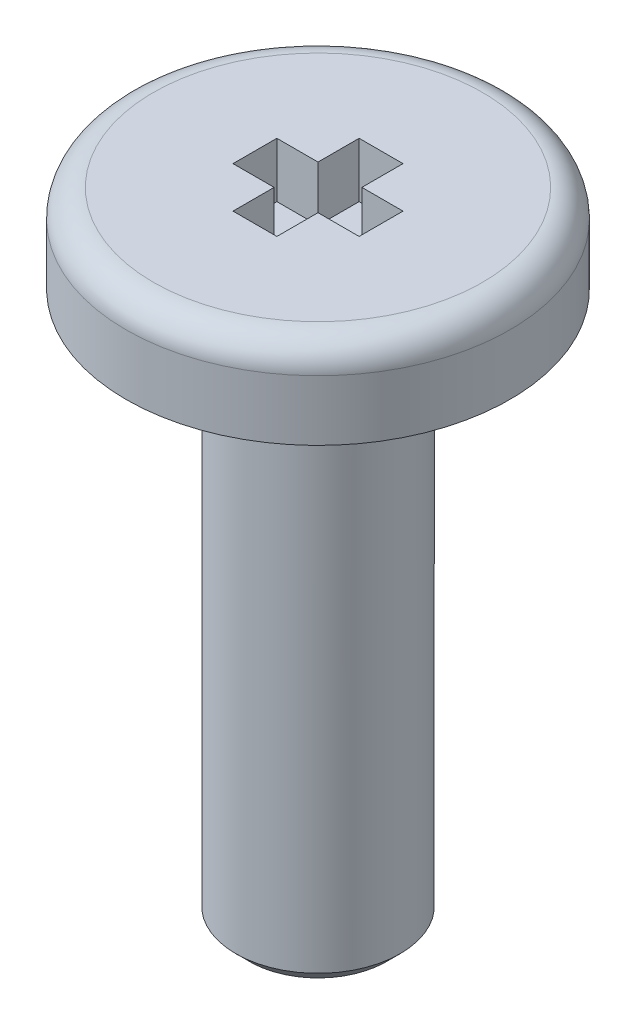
ISO-10303-21;
HEADER;
FILE_DESCRIPTION(('STEP AP214'),'2;1');
FILE_NAME('part.step','',(''),(''),'','','');
FILE_SCHEMA(('AUTOMOTIVE_DESIGN { 1 0 10303 214 1 1 1 1 }'));
ENDSEC;
DATA;
#1=APPLICATION_CONTEXT('core data for automotive mechanical design processes');
#2=APPLICATION_PROTOCOL_DEFINITION('international standard','automotive_design',2000,#1);
#3=PRODUCT_CONTEXT('',#1,'mechanical');
#4=PRODUCT('Part','Part','',(#3));
#5=PRODUCT_RELATED_PRODUCT_CATEGORY('part','',(#4));
#6=PRODUCT_DEFINITION_FORMATION('','',#4);
#7=PRODUCT_DEFINITION_CONTEXT('part definition',#1,'design');
#8=PRODUCT_DEFINITION('design','',#6,#7);
#9=PRODUCT_DEFINITION_SHAPE('','',#8);
#10=(LENGTH_UNIT() NAMED_UNIT(*) SI_UNIT(.MILLI.,.METRE.));
#11=(NAMED_UNIT(*) PLANE_ANGLE_UNIT() SI_UNIT($,.RADIAN.));
#12=(NAMED_UNIT(*) SI_UNIT($,.STERADIAN.) SOLID_ANGLE_UNIT());
#13=UNCERTAINTY_MEASURE_WITH_UNIT(LENGTH_MEASURE(1.E-05),#10,'distance_accuracy_value','');
#14=(GEOMETRIC_REPRESENTATION_CONTEXT(3) GLOBAL_UNCERTAINTY_ASSIGNED_CONTEXT((#13)) GLOBAL_UNIT_ASSIGNED_CONTEXT((#10,
#11,#12)) REPRESENTATION_CONTEXT('',''));
#15=CARTESIAN_POINT('',(0.,0.,0.));
#16=DIRECTION('',(0.,0.,1.));
#17=DIRECTION('',(1.,0.,0.));
#18=AXIS2_PLACEMENT_3D('',#15,#16,#17);
#19=CARTESIAN_POINT('',(3.5,0.,0.));
#20=DIRECTION('',(0.,1.,0.));
#21=DIRECTION('',(0.,0.,1.));
#22=AXIS2_PLACEMENT_3D('',#19,#20,#21);
#23=PLANE('',#22);
#24=CARTESIAN_POINT('',(0.,0.,0.));
#25=DIRECTION('',(0.,1.,0.));
#26=DIRECTION('',(0.,0.,1.));
#27=AXIS2_PLACEMENT_3D('',#24,#25,#26);
#28=CIRCLE('',#27,1.7);
#29=CARTESIAN_POINT('',(0.,0.,1.7));
#30=VERTEX_POINT('',#29);
#31=EDGE_CURVE('E209',#30,#30,#28,.T.);
#32=ORIENTED_EDGE('',*,*,#31,.T.);
#33=EDGE_LOOP('',(#32));
#34=FACE_BOUND('',#33,.T.);
#35=CARTESIAN_POINT('',(0.,0.,0.));
#36=DIRECTION('',(0.,1.,0.));
#37=DIRECTION('',(0.,0.,1.));
#38=AXIS2_PLACEMENT_3D('',#35,#36,#37);
#39=CIRCLE('',#38,3.5);
#40=CARTESIAN_POINT('',(0.,0.,3.5));
#41=VERTEX_POINT('',#40);
#42=EDGE_CURVE('E203',#41,#41,#39,.T.);
#43=ORIENTED_EDGE('',*,*,#42,.F.);
#44=EDGE_LOOP('',(#43));
#45=FACE_BOUND('',#44,.T.);
#46=ADVANCED_FACE('F31',(#34,#45),#23,.F.);
#47=CARTESIAN_POINT('',(0.4,0.6,1.15));
#48=DIRECTION('',(1.,0.,0.));
#49=DIRECTION('',(0.,0.,-1.));
#50=AXIS2_PLACEMENT_3D('',#47,#48,#49);
#51=PLANE('',#50);
#52=DIRECTION('',(0.,1.,0.));
#53=VECTOR('',#52,1.);
#54=CARTESIAN_POINT('',(0.4,0.6,0.399999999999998));
#55=LINE('',#54,#53);
#56=CARTESIAN_POINT('',(0.4,0.6,0.399999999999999));
#57=VERTEX_POINT('',#56);
#58=CARTESIAN_POINT('',(0.4,1.6,0.399999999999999));
#59=VERTEX_POINT('',#58);
#60=EDGE_CURVE('E153',#57,#59,#55,.T.);
#61=ORIENTED_EDGE('',*,*,#60,.F.);
#62=DIRECTION('',(0.,0.,-1.));
#63=VECTOR('',#62,1.);
#64=CARTESIAN_POINT('',(0.4,0.6,1.15));
#65=LINE('',#64,#63);
#66=CARTESIAN_POINT('',(0.4,0.6,1.15));
#67=VERTEX_POINT('',#66);
#68=EDGE_CURVE('E162',#67,#57,#65,.T.);
#69=ORIENTED_EDGE('',*,*,#68,.F.);
#70=DIRECTION('',(0.,1.,0.));
#71=VECTOR('',#70,1.);
#72=CARTESIAN_POINT('',(0.4,0.6,1.15));
#73=LINE('',#72,#71);
#74=CARTESIAN_POINT('',(0.4,1.6,1.15));
#75=VERTEX_POINT('',#74);
#76=EDGE_CURVE('E188',#67,#75,#73,.T.);
#77=ORIENTED_EDGE('',*,*,#76,.T.);
#78=DIRECTION('',(0.,0.,-1.));
#79=VECTOR('',#78,1.);
#80=CARTESIAN_POINT('',(0.4,1.6,1.15));
#81=LINE('',#80,#79);
#82=EDGE_CURVE('E175',#75,#59,#81,.T.);
#83=ORIENTED_EDGE('',*,*,#82,.T.);
#84=EDGE_LOOP('',(#61,#69,#77,#83));
#85=FACE_BOUND('',#84,.T.);
#86=ADVANCED_FACE('F225',(#85),#51,.F.);
#87=CARTESIAN_POINT('',(-0.4,0.6,1.15));
#88=DIRECTION('',(1.,0.,0.));
#89=DIRECTION('',(0.,0.,-1.));
#90=AXIS2_PLACEMENT_3D('',#87,#88,#89);
#91=PLANE('',#90);
#92=DIRECTION('',(0.,0.,-1.));
#93=VECTOR('',#92,1.);
#94=CARTESIAN_POINT('',(-0.4,0.6,1.15));
#95=LINE('',#94,#93);
#96=CARTESIAN_POINT('',(-0.4,0.6,1.15));
#97=VERTEX_POINT('',#96);
#98=CARTESIAN_POINT('',(-0.4,0.6,0.4));
#99=VERTEX_POINT('',#98);
#100=EDGE_CURVE('E169',#97,#99,#95,.T.);
#101=ORIENTED_EDGE('',*,*,#100,.T.);
#102=DIRECTION('',(0.,1.,0.));
#103=VECTOR('',#102,1.);
#104=CARTESIAN_POINT('',(-0.4,0.6,0.400000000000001));
#105=LINE('',#104,#103);
#106=CARTESIAN_POINT('',(-0.4,1.6,0.400000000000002));
#107=VERTEX_POINT('',#106);
#108=EDGE_CURVE('E150',#99,#107,#105,.T.);
#109=ORIENTED_EDGE('',*,*,#108,.T.);
#110=DIRECTION('',(0.,0.,-1.));
#111=VECTOR('',#110,1.);
#112=CARTESIAN_POINT('',(-0.4,1.6,1.15));
#113=LINE('',#112,#111);
#114=CARTESIAN_POINT('',(-0.4,1.6,1.15));
#115=VERTEX_POINT('',#114);
#116=EDGE_CURVE('E182',#115,#107,#113,.T.);
#117=ORIENTED_EDGE('',*,*,#116,.F.);
#118=DIRECTION('',(0.,1.,0.));
#119=VECTOR('',#118,1.);
#120=CARTESIAN_POINT('',(-0.4,0.6,1.15));
#121=LINE('',#120,#119);
#122=EDGE_CURVE('E191',#97,#115,#121,.T.);
#123=ORIENTED_EDGE('',*,*,#122,.F.);
#124=EDGE_LOOP('',(#101,#109,#117,#123));
#125=FACE_BOUND('',#124,.T.);
#126=ADVANCED_FACE('F231',(#125),#91,.T.);
#127=CARTESIAN_POINT('',(0.,11.592517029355,0.));
#128=DIRECTION('',(0.,1.,0.));
#129=DIRECTION('',(0.,0.,1.));
#130=AXIS2_PLACEMENT_3D('',#127,#128,#129);
#131=CYLINDRICAL_SURFACE('',#130,3.5);
#132=CARTESIAN_POINT('',(0.,1.1,0.));
#133=DIRECTION('',(0.,1.,0.));
#134=DIRECTION('',(0.,0.,1.));
#135=AXIS2_PLACEMENT_3D('',#132,#133,#134);
#136=CIRCLE('',#135,3.5);
#137=CARTESIAN_POINT('',(0.,1.1,3.5));
#138=VERTEX_POINT('',#137);
#139=EDGE_CURVE('E200',#138,#138,#136,.T.);
#140=ORIENTED_EDGE('',*,*,#139,.F.);
#141=EDGE_LOOP('',(#140));
#142=FACE_BOUND('',#141,.T.);
#143=ORIENTED_EDGE('',*,*,#42,.T.);
#144=EDGE_LOOP('',(#143));
#145=FACE_BOUND('',#144,.T.);
#146=ADVANCED_FACE('F237',(#142,#145),#131,.T.);
#147=CARTESIAN_POINT('',(0.,1.1,0.));
#148=DIRECTION('',(0.,1.,0.));
#149=DIRECTION('',(0.,0.,1.));
#150=AXIS2_PLACEMENT_3D('',#147,#148,#149);
#151=TOROIDAL_SURFACE('',#150,3.,0.5);
#152=CARTESIAN_POINT('',(0.,1.6,0.));
#153=DIRECTION('',(0.,1.,0.));
#154=DIRECTION('',(0.,0.,1.));
#155=AXIS2_PLACEMENT_3D('',#152,#153,#154);
#156=CIRCLE('',#155,3.);
#157=CARTESIAN_POINT('',(0.,1.6,3.));
#158=VERTEX_POINT('',#157);
#159=EDGE_CURVE('E190',#158,#158,#156,.T.);
#160=ORIENTED_EDGE('',*,*,#159,.F.);
#161=EDGE_LOOP('',(#160));
#162=FACE_BOUND('',#161,.T.);
#163=ORIENTED_EDGE('',*,*,#139,.T.);
#164=EDGE_LOOP('',(#163));
#165=FACE_BOUND('',#164,.T.);
#166=ADVANCED_FACE('F240',(#162,#165),#151,.T.);
#167=CARTESIAN_POINT('',(0.,1.6,0.));
#168=DIRECTION('',(0.,-1.,0.));
#169=DIRECTION('',(0.,0.,-1.));
#170=AXIS2_PLACEMENT_3D('',#167,#168,#169);
#171=PLANE('',#170);
#172=CARTESIAN_POINT('',(0.4,1.6,-0.400000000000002));
#173=VERTEX_POINT('',#172);
#174=CARTESIAN_POINT('',(0.4,1.6,-1.15));
#175=VERTEX_POINT('',#174);
#176=EDGE_CURVE('E161',#173,#175,#81,.T.);
#177=ORIENTED_EDGE('',*,*,#176,.F.);
#178=DIRECTION('',(-1.,0.,0.));
#179=VECTOR('',#178,1.);
#180=CARTESIAN_POINT('',(1.15,1.6,-0.400000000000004));
#181=LINE('',#180,#179);
#182=CARTESIAN_POINT('',(1.15,1.6,-0.400000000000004));
#183=VERTEX_POINT('',#182);
#184=EDGE_CURVE('E438',#183,#173,#181,.T.);
#185=ORIENTED_EDGE('',*,*,#184,.F.);
#186=DIRECTION('',(0.,0.,1.));
#187=VECTOR('',#186,1.);
#188=CARTESIAN_POINT('',(1.15,1.6,-0.400000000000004));
#189=LINE('',#188,#187);
#190=CARTESIAN_POINT('',(1.15,1.6,0.399999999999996));
#191=VERTEX_POINT('',#190);
#192=EDGE_CURVE('E128',#183,#191,#189,.T.);
#193=ORIENTED_EDGE('',*,*,#192,.T.);
#194=DIRECTION('',(-1.,0.,0.));
#195=VECTOR('',#194,1.);
#196=CARTESIAN_POINT('',(1.15,1.6,0.399999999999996));
#197=LINE('',#196,#195);
#198=EDGE_CURVE('E423',#191,#59,#197,.T.);
#199=ORIENTED_EDGE('',*,*,#198,.T.);
#200=ORIENTED_EDGE('',*,*,#82,.F.);
#201=DIRECTION('',(-1.,0.,0.));
#202=VECTOR('',#201,1.);
#203=CARTESIAN_POINT('',(0.4,1.6,1.15));
#204=LINE('',#203,#202);
#205=EDGE_CURVE('E185',#75,#115,#204,.T.);
#206=ORIENTED_EDGE('',*,*,#205,.T.);
#207=ORIENTED_EDGE('',*,*,#116,.T.);
#208=CARTESIAN_POINT('',(-1.15,1.6,0.400000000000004));
#209=VERTEX_POINT('',#208);
#210=EDGE_CURVE('E429',#107,#209,#197,.T.);
#211=ORIENTED_EDGE('',*,*,#210,.T.);
#212=DIRECTION('',(0.,0.,-1.));
#213=VECTOR('',#212,1.);
#214=CARTESIAN_POINT('',(-1.15,1.6,0.400000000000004));
#215=LINE('',#214,#213);
#216=CARTESIAN_POINT('',(-1.15,1.6,-0.399999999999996));
#217=VERTEX_POINT('',#216);
#218=EDGE_CURVE('E433',#209,#217,#215,.T.);
#219=ORIENTED_EDGE('',*,*,#218,.T.);
#220=CARTESIAN_POINT('',(-0.4,1.6,-0.399999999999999));
#221=VERTEX_POINT('',#220);
#222=EDGE_CURVE('E141',#221,#217,#181,.T.);
#223=ORIENTED_EDGE('',*,*,#222,.F.);
#224=CARTESIAN_POINT('',(-0.4,1.6,-1.15));
#225=VERTEX_POINT('',#224);
#226=EDGE_CURVE('E181',#221,#225,#113,.T.);
#227=ORIENTED_EDGE('',*,*,#226,.T.);
#228=DIRECTION('',(1.,0.,0.));
#229=VECTOR('',#228,1.);
#230=CARTESIAN_POINT('',(-0.4,1.6,-1.15));
#231=LINE('',#230,#229);
#232=EDGE_CURVE('E178',#225,#175,#231,.T.);
#233=ORIENTED_EDGE('',*,*,#232,.T.);
#234=EDGE_LOOP('',(#177,#185,#193,#199,#200,#206,#207,#211,#219,#223,#227,#233));
#235=FACE_BOUND('',#234,.T.);
#236=ORIENTED_EDGE('',*,*,#159,.T.);
#237=EDGE_LOOP('',(#236));
#238=FACE_BOUND('',#237,.T.);
#239=ADVANCED_FACE('F244',(#235,#238),#171,.F.);
#240=CARTESIAN_POINT('',(0.4,0.6,-0.4));
#241=VERTEX_POINT('',#240);
#242=CARTESIAN_POINT('',(0.4,0.6,-1.15));
#243=VERTEX_POINT('',#242);
#244=EDGE_CURVE('E166',#241,#243,#65,.T.);
#245=ORIENTED_EDGE('',*,*,#244,.F.);
#246=DIRECTION('',(0.,1.,0.));
#247=VECTOR('',#246,1.);
#248=CARTESIAN_POINT('',(0.4,0.6,-0.400000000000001));
#249=LINE('',#248,#247);
#250=EDGE_CURVE('E158',#241,#173,#249,.T.);
#251=ORIENTED_EDGE('',*,*,#250,.T.);
#252=ORIENTED_EDGE('',*,*,#176,.T.);
#253=DIRECTION('',(0.,1.,0.));
#254=VECTOR('',#253,1.);
#255=CARTESIAN_POINT('',(0.4,0.6,-1.15));
#256=LINE('',#255,#254);
#257=EDGE_CURVE('E174',#243,#175,#256,.T.);
#258=ORIENTED_EDGE('',*,*,#257,.F.);
#259=EDGE_LOOP('',(#245,#251,#252,#258));
#260=FACE_BOUND('',#259,.T.);
#261=ADVANCED_FACE('F234',(#260),#51,.F.);
#262=CARTESIAN_POINT('',(0.4,0.6,1.15));
#263=DIRECTION('',(0.,0.,-1.));
#264=DIRECTION('',(-1.,0.,0.));
#265=AXIS2_PLACEMENT_3D('',#262,#263,#264);
#266=PLANE('',#265);
#267=ORIENTED_EDGE('',*,*,#205,.F.);
#268=ORIENTED_EDGE('',*,*,#76,.F.);
#269=DIRECTION('',(-1.,0.,0.));
#270=VECTOR('',#269,1.);
#271=CARTESIAN_POINT('',(0.4,0.6,1.15));
#272=LINE('',#271,#270);
#273=EDGE_CURVE('E172',#67,#97,#272,.T.);
#274=ORIENTED_EDGE('',*,*,#273,.T.);
#275=ORIENTED_EDGE('',*,*,#122,.T.);
#276=EDGE_LOOP('',(#267,#268,#274,#275));
#277=FACE_BOUND('',#276,.T.);
#278=ADVANCED_FACE('F250',(#277),#266,.T.);
#279=DIRECTION('',(0.,1.,0.));
#280=VECTOR('',#279,1.);
#281=CARTESIAN_POINT('',(-0.4,0.6,-0.399999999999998));
#282=LINE('',#281,#280);
#283=CARTESIAN_POINT('',(-0.4,0.6,-0.399999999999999));
#284=VERTEX_POINT('',#283);
#285=EDGE_CURVE('E156',#284,#221,#282,.T.);
#286=ORIENTED_EDGE('',*,*,#285,.F.);
#287=CARTESIAN_POINT('',(-0.4,0.6,-1.15));
#288=VERTEX_POINT('',#287);
#289=EDGE_CURVE('E124',#284,#288,#95,.T.);
#290=ORIENTED_EDGE('',*,*,#289,.T.);
#291=DIRECTION('',(0.,1.,0.));
#292=VECTOR('',#291,1.);
#293=CARTESIAN_POINT('',(-0.4,0.6,-1.15));
#294=LINE('',#293,#292);
#295=EDGE_CURVE('E193',#288,#225,#294,.T.);
#296=ORIENTED_EDGE('',*,*,#295,.T.);
#297=ORIENTED_EDGE('',*,*,#226,.F.);
#298=EDGE_LOOP('',(#286,#290,#296,#297));
#299=FACE_BOUND('',#298,.T.);
#300=ADVANCED_FACE('F255',(#299),#91,.T.);
#301=CARTESIAN_POINT('',(-0.4,0.6,-1.15));
#302=DIRECTION('',(0.,0.,1.));
#303=DIRECTION('',(1.,0.,0.));
#304=AXIS2_PLACEMENT_3D('',#301,#302,#303);
#305=PLANE('',#304);
#306=ORIENTED_EDGE('',*,*,#232,.F.);
#307=ORIENTED_EDGE('',*,*,#295,.F.);
#308=DIRECTION('',(1.,0.,0.));
#309=VECTOR('',#308,1.);
#310=CARTESIAN_POINT('',(-0.4,0.6,-1.15));
#311=LINE('',#310,#309);
#312=EDGE_CURVE('E165',#288,#243,#311,.T.);
#313=ORIENTED_EDGE('',*,*,#312,.T.);
#314=ORIENTED_EDGE('',*,*,#257,.T.);
#315=EDGE_LOOP('',(#306,#307,#313,#314));
#316=FACE_BOUND('',#315,.T.);
#317=ADVANCED_FACE('F252',(#316),#305,.T.);
#318=CARTESIAN_POINT('',(0.4,0.6,-1.15));
#319=DIRECTION('',(0.,-1.,0.));
#320=DIRECTION('',(0.,0.,-1.));
#321=AXIS2_PLACEMENT_3D('',#318,#319,#320);
#322=PLANE('',#321);
#323=ORIENTED_EDGE('',*,*,#289,.F.);
#324=DIRECTION('',(-1.,0.,0.));
#325=VECTOR('',#324,1.);
#326=CARTESIAN_POINT('',(1.15,0.6,-0.400000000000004));
#327=LINE('',#326,#325);
#328=CARTESIAN_POINT('',(-1.15,0.6,-0.399999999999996));
#329=VERTEX_POINT('',#328);
#330=EDGE_CURVE('E119',#284,#329,#327,.T.);
#331=ORIENTED_EDGE('',*,*,#330,.T.);
#332=DIRECTION('',(0.,0.,-1.));
#333=VECTOR('',#332,1.);
#334=CARTESIAN_POINT('',(-1.15,0.6,0.400000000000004));
#335=LINE('',#334,#333);
#336=CARTESIAN_POINT('',(-1.15,0.6,0.400000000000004));
#337=VERTEX_POINT('',#336);
#338=EDGE_CURVE('E122',#337,#329,#335,.T.);
#339=ORIENTED_EDGE('',*,*,#338,.F.);
#340=DIRECTION('',(-1.,0.,0.));
#341=VECTOR('',#340,1.);
#342=CARTESIAN_POINT('',(1.15,0.6,0.399999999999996));
#343=LINE('',#342,#341);
#344=EDGE_CURVE('E46',#99,#337,#343,.T.);
#345=ORIENTED_EDGE('',*,*,#344,.F.);
#346=ORIENTED_EDGE('',*,*,#100,.F.);
#347=ORIENTED_EDGE('',*,*,#273,.F.);
#348=ORIENTED_EDGE('',*,*,#68,.T.);
#349=CARTESIAN_POINT('',(1.15,0.6,0.399999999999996));
#350=VERTEX_POINT('',#349);
#351=EDGE_CURVE('E146',#350,#57,#343,.T.);
#352=ORIENTED_EDGE('',*,*,#351,.F.);
#353=DIRECTION('',(0.,0.,1.));
#354=VECTOR('',#353,1.);
#355=CARTESIAN_POINT('',(1.15,0.6,-0.400000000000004));
#356=LINE('',#355,#354);
#357=CARTESIAN_POINT('',(1.15,0.6,-0.400000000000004));
#358=VERTEX_POINT('',#357);
#359=EDGE_CURVE('E142',#358,#350,#356,.T.);
#360=ORIENTED_EDGE('',*,*,#359,.F.);
#361=EDGE_CURVE('E53',#358,#241,#327,.T.);
#362=ORIENTED_EDGE('',*,*,#361,.T.);
#363=ORIENTED_EDGE('',*,*,#244,.T.);
#364=ORIENTED_EDGE('',*,*,#312,.F.);
#365=EDGE_LOOP('',(#323,#331,#339,#345,#346,#347,#348,#352,#360,#362,#363,#364));
#366=FACE_BOUND('',#365,.T.);
#367=ADVANCED_FACE('F121',(#366),#322,.F.);
#368=CARTESIAN_POINT('',(1.15,0.6,0.399999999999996));
#369=DIRECTION('',(0.,0.,-1.));
#370=DIRECTION('',(-1.,0.,0.));
#371=AXIS2_PLACEMENT_3D('',#368,#369,#370);
#372=PLANE('',#371);
#373=ORIENTED_EDGE('',*,*,#344,.T.);
#374=DIRECTION('',(0.,1.,0.));
#375=VECTOR('',#374,1.);
#376=CARTESIAN_POINT('',(-1.15,0.6,0.400000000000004));
#377=LINE('',#376,#375);
#378=EDGE_CURVE('E137',#337,#209,#377,.T.);
#379=ORIENTED_EDGE('',*,*,#378,.T.);
#380=ORIENTED_EDGE('',*,*,#210,.F.);
#381=ORIENTED_EDGE('',*,*,#108,.F.);
#382=EDGE_LOOP('',(#373,#379,#380,#381));
#383=FACE_BOUND('',#382,.T.);
#384=ADVANCED_FACE('F265',(#383),#372,.T.);
#385=CARTESIAN_POINT('',(1.15,0.6,-0.400000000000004));
#386=DIRECTION('',(0.,0.,-1.));
#387=DIRECTION('',(-1.,0.,0.));
#388=AXIS2_PLACEMENT_3D('',#385,#386,#387);
#389=PLANE('',#388);
#390=ORIENTED_EDGE('',*,*,#285,.T.);
#391=ORIENTED_EDGE('',*,*,#222,.T.);
#392=DIRECTION('',(0.,1.,0.));
#393=VECTOR('',#392,1.);
#394=CARTESIAN_POINT('',(-1.15,0.6,-0.399999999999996));
#395=LINE('',#394,#393);
#396=EDGE_CURVE('E135',#329,#217,#395,.T.);
#397=ORIENTED_EDGE('',*,*,#396,.F.);
#398=ORIENTED_EDGE('',*,*,#330,.F.);
#399=EDGE_LOOP('',(#390,#391,#397,#398));
#400=FACE_BOUND('',#399,.T.);
#401=ADVANCED_FACE('F139',(#400),#389,.F.);
#402=CARTESIAN_POINT('',(-1.15,0.6,0.400000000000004));
#403=DIRECTION('',(1.,0.,0.));
#404=DIRECTION('',(0.,0.,-1.));
#405=AXIS2_PLACEMENT_3D('',#402,#403,#404);
#406=PLANE('',#405);
#407=ORIENTED_EDGE('',*,*,#218,.F.);
#408=ORIENTED_EDGE('',*,*,#378,.F.);
#409=ORIENTED_EDGE('',*,*,#338,.T.);
#410=ORIENTED_EDGE('',*,*,#396,.T.);
#411=EDGE_LOOP('',(#407,#408,#409,#410));
#412=FACE_BOUND('',#411,.T.);
#413=ADVANCED_FACE('F134',(#412),#406,.T.);
#414=ORIENTED_EDGE('',*,*,#361,.F.);
#415=DIRECTION('',(0.,1.,0.));
#416=VECTOR('',#415,1.);
#417=CARTESIAN_POINT('',(1.15,0.6,-0.400000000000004));
#418=LINE('',#417,#416);
#419=EDGE_CURVE('E154',#358,#183,#418,.T.);
#420=ORIENTED_EDGE('',*,*,#419,.T.);
#421=ORIENTED_EDGE('',*,*,#184,.T.);
#422=ORIENTED_EDGE('',*,*,#250,.F.);
#423=EDGE_LOOP('',(#414,#420,#421,#422));
#424=FACE_BOUND('',#423,.T.);
#425=ADVANCED_FACE('F268',(#424),#389,.F.);
#426=ORIENTED_EDGE('',*,*,#60,.T.);
#427=ORIENTED_EDGE('',*,*,#198,.F.);
#428=DIRECTION('',(0.,1.,0.));
#429=VECTOR('',#428,1.);
#430=CARTESIAN_POINT('',(1.15,0.6,0.399999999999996));
#431=LINE('',#430,#429);
#432=EDGE_CURVE('E144',#350,#191,#431,.T.);
#433=ORIENTED_EDGE('',*,*,#432,.F.);
#434=ORIENTED_EDGE('',*,*,#351,.T.);
#435=EDGE_LOOP('',(#426,#427,#433,#434));
#436=FACE_BOUND('',#435,.T.);
#437=ADVANCED_FACE('F274',(#436),#372,.T.);
#438=CARTESIAN_POINT('',(1.15,0.6,-0.400000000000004));
#439=DIRECTION('',(-1.,0.,0.));
#440=DIRECTION('',(0.,0.,1.));
#441=AXIS2_PLACEMENT_3D('',#438,#439,#440);
#442=PLANE('',#441);
#443=ORIENTED_EDGE('',*,*,#192,.F.);
#444=ORIENTED_EDGE('',*,*,#419,.F.);
#445=ORIENTED_EDGE('',*,*,#359,.T.);
#446=ORIENTED_EDGE('',*,*,#432,.T.);
#447=EDGE_LOOP('',(#443,#444,#445,#446));
#448=FACE_BOUND('',#447,.T.);
#449=ADVANCED_FACE('F275',(#448),#442,.T.);
#450=CARTESIAN_POINT('',(0.,-10.,0.));
#451=DIRECTION('',(0.,1.,0.));
#452=DIRECTION('',(0.,0.,1.));
#453=AXIS2_PLACEMENT_3D('',#450,#451,#452);
#454=CYLINDRICAL_SURFACE('',#453,1.5);
#455=CARTESIAN_POINT('',(0.,-9.75,0.));
#456=DIRECTION('',(0.,-1.,0.));
#457=DIRECTION('',(0.,0.,-1.));
#458=AXIS2_PLACEMENT_3D('',#455,#456,#457);
#459=CIRCLE('',#458,1.5);
#460=CARTESIAN_POINT('',(0.,-9.75,-1.5));
#461=VERTEX_POINT('',#460);
#462=EDGE_CURVE('E11',#461,#461,#459,.F.);
#463=ORIENTED_EDGE('',*,*,#462,.T.);
#464=EDGE_LOOP('',(#463));
#465=FACE_BOUND('',#464,.T.);
#466=CARTESIAN_POINT('',(0.,-0.200000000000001,0.));
#467=DIRECTION('',(0.,1.,0.));
#468=DIRECTION('',(0.,0.,1.));
#469=AXIS2_PLACEMENT_3D('',#466,#467,#468);
#470=CIRCLE('',#469,1.5);
#471=CARTESIAN_POINT('',(0.,-0.200000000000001,1.5));
#472=VERTEX_POINT('',#471);
#473=EDGE_CURVE('E206',#472,#472,#470,.F.);
#474=ORIENTED_EDGE('',*,*,#473,.T.);
#475=EDGE_LOOP('',(#474));
#476=FACE_BOUND('',#475,.T.);
#477=ADVANCED_FACE('F278',(#465,#476),#454,.T.);
#478=CARTESIAN_POINT('',(0.,-10.,0.));
#479=DIRECTION('',(0.,-1.,0.));
#480=DIRECTION('',(0.,0.,-1.));
#481=AXIS2_PLACEMENT_3D('',#478,#479,#480);
#482=PLANE('',#481);
#483=CARTESIAN_POINT('',(0.,-10.,0.));
#484=DIRECTION('',(0.,-1.,0.));
#485=DIRECTION('',(0.,0.,-1.));
#486=AXIS2_PLACEMENT_3D('',#483,#484,#485);
#487=CIRCLE('',#486,1.25);
#488=CARTESIAN_POINT('',(0.,-10.,-1.25));
#489=VERTEX_POINT('',#488);
#490=EDGE_CURVE('E39',#489,#489,#487,.T.);
#491=ORIENTED_EDGE('',*,*,#490,.T.);
#492=EDGE_LOOP('',(#491));
#493=FACE_BOUND('',#492,.T.);
#494=ADVANCED_FACE('F214',(#493),#482,.T.);
#495=CARTESIAN_POINT('',(0.,-0.200000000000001,0.));
#496=DIRECTION('',(0.,1.,0.));
#497=DIRECTION('',(0.,0.,1.));
#498=AXIS2_PLACEMENT_3D('',#495,#496,#497);
#499=TOROIDAL_SURFACE('',#498,1.7,0.2);
#500=ORIENTED_EDGE('',*,*,#31,.F.);
#501=EDGE_LOOP('',(#500));
#502=FACE_BOUND('',#501,.T.);
#503=ORIENTED_EDGE('',*,*,#473,.F.);
#504=EDGE_LOOP('',(#503));
#505=FACE_BOUND('',#504,.T.);
#506=ADVANCED_FACE('F217',(#502,#505),#499,.F.);
#507=CARTESIAN_POINT('',(0.,-10.,0.));
#508=DIRECTION('',(0.,1.,0.));
#509=DIRECTION('',(0.,0.,1.));
#510=AXIS2_PLACEMENT_3D('',#507,#508,#509);
#511=CONICAL_SURFACE('',#510,1.25,0.785398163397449);
#512=ORIENTED_EDGE('',*,*,#462,.F.);
#513=EDGE_LOOP('',(#512));
#514=FACE_BOUND('',#513,.T.);
#515=ORIENTED_EDGE('',*,*,#490,.F.);
#516=EDGE_LOOP('',(#515));
#517=FACE_BOUND('',#516,.T.);
#518=ADVANCED_FACE('F33',(#514,#517),#511,.T.);
#519=CLOSED_SHELL('',(#46,#86,#126,#146,#166,#239,#261,#278,#300,#317,#367,#384,#401,#413,#425,
#437,#449,#477,#494,#506,#518));
#520=MANIFOLD_SOLID_BREP('B2',#519);
#521=ADVANCED_BREP_SHAPE_REPRESENTATION('',(#18,#520),#14);
#522=SHAPE_DEFINITION_REPRESENTATION(#9,#521);
ENDSEC;
END-ISO-10303-21;
